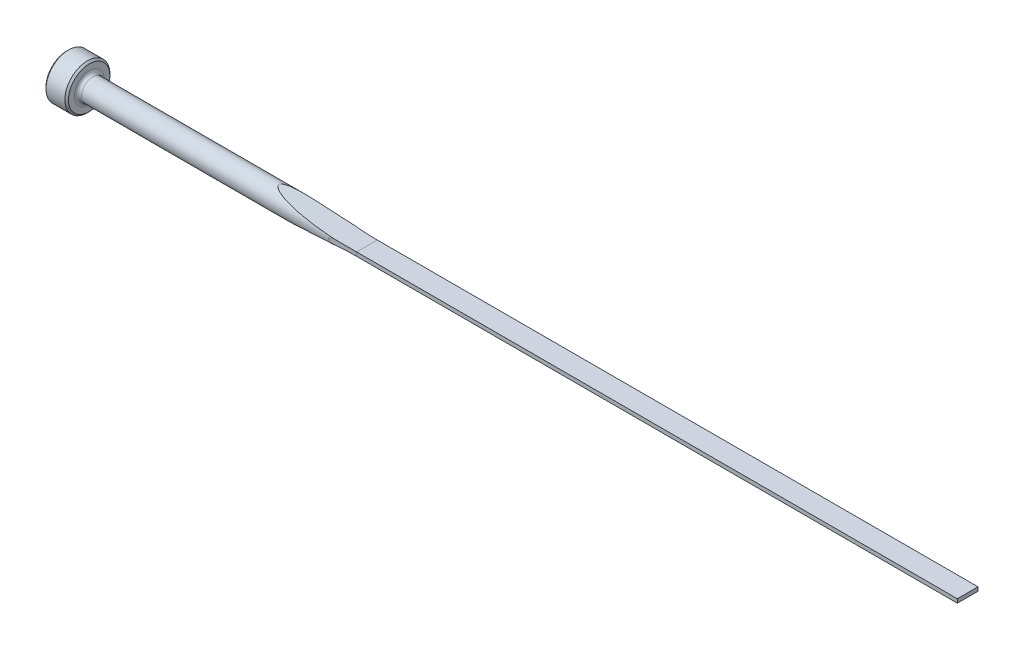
from build123d import *

# Parameters (mm, degrees)
CUT_EXTRUDE1_DEPTH = 191.619025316
CUT_EXTRUDE2_DEPTH = 191.619025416
FILLET1_R          = 0.762
CHAMFER1_SIZE      = 0.381


with BuildPart() as part:
    # Sketch1 → Revolve1 (revolve)
    with BuildSketch(Plane.XY, mode=Mode.PRIVATE) as revolve1_sk:
        Polygon((0, 0), (0, 4.7625), (4.7498, 4.7625), (4.7498, 2.3749), (190.5, 2.3749), (190.5, 0), align=None)
    revolve(revolve1_sk.sketch.rotate(Axis((0, 0, 0), (1, 0, 0)), 90), axis=Axis((0, 0, 0), (1, 0, 0)))

    # Sketch2 → Cut-Extrude1 (cut, symmetric)
    with BuildSketch(Plane.XY):
        with BuildLine():
            Line((190.5, 2.3749), (190.5, 0.4064))
            Line((190.5, 0.4064), (63.5, 0.4064))
            ThreePointArc((63.5, 0.4064), (54.145865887, 0.899894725), (44.895583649, 2.3749))
            Line((44.895583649, 2.3749), (190.5, 2.3749))
        make_face()
    cut_extrude1 = extrude(amount=CUT_EXTRUDE1_DEPTH, both=True, mode=Mode.SUBTRACT)

    # Mirror1: Cut-Extrude1 across plane
    add(cut_extrude1.mirror(Plane.ZX), mode=Mode.SUBTRACT)

    # Sketch3 → Cut-Extrude2 (cut, symmetric)
    with BuildSketch(Plane(origin=(0, 0, 0), x_dir=(1, 0, 0), z_dir=(0, 1, 0))):
        with BuildLine():
            Line((190.5, 2.3749), (190.5, 2.1844))
            Line((190.5, 2.1844), (63.5, 2.1844))
            ThreePointArc((63.5, 2.1844), (60.590064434, 2.232037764), (57.683247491, 2.3749))
            Line((57.683247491, 2.3749), (190.5, 2.3749))
        make_face()
    cut_extrude2 = extrude(amount=CUT_EXTRUDE2_DEPTH, both=True, mode=Mode.SUBTRACT)

    # Mirror2: Cut-Extrude2 across plane
    add(cut_extrude2.mirror(Plane.XY), mode=Mode.SUBTRACT)

    # Fillet1
    fillet1_edges = [part.edges().sort_by_distance(p)[0] for p in [
        (4.7498, 0, -2.3749),
    ]]
    fillet(fillet1_edges, radius=FILLET1_R)

    # Chamfer1
    chamfer1_edges = [part.edges().sort_by_distance(p)[0] for p in [
        (4.7498, 0, -4.7625),
        (0, 0, -4.7625),
    ]]
    chamfer(chamfer1_edges, length=CHAMFER1_SIZE)


solid = part.part
